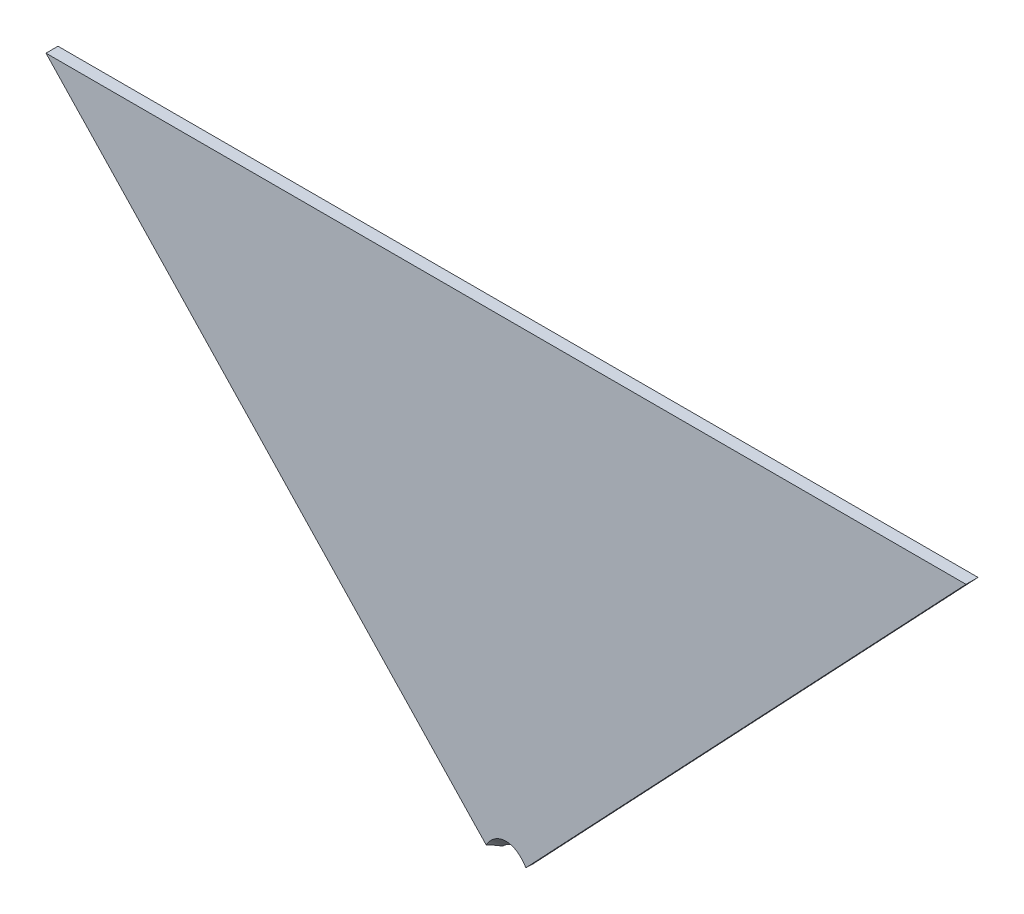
ISO-10303-21;
HEADER;
FILE_DESCRIPTION(('STEP AP214'),'2;1');
FILE_NAME('part.step','',(''),(''),'','','');
FILE_SCHEMA(('AUTOMOTIVE_DESIGN { 1 0 10303 214 1 1 1 1 }'));
ENDSEC;
DATA;
#1=APPLICATION_CONTEXT('core data for automotive mechanical design processes');
#2=APPLICATION_PROTOCOL_DEFINITION('international standard','automotive_design',2000,#1);
#3=PRODUCT_CONTEXT('',#1,'mechanical');
#4=PRODUCT('Part','Part','',(#3));
#5=PRODUCT_RELATED_PRODUCT_CATEGORY('part','',(#4));
#6=PRODUCT_DEFINITION_FORMATION('','',#4);
#7=PRODUCT_DEFINITION_CONTEXT('part definition',#1,'design');
#8=PRODUCT_DEFINITION('design','',#6,#7);
#9=PRODUCT_DEFINITION_SHAPE('','',#8);
#10=(LENGTH_UNIT() NAMED_UNIT(*) SI_UNIT(.MILLI.,.METRE.));
#11=(NAMED_UNIT(*) PLANE_ANGLE_UNIT() SI_UNIT($,.RADIAN.));
#12=(NAMED_UNIT(*) SI_UNIT($,.STERADIAN.) SOLID_ANGLE_UNIT());
#13=UNCERTAINTY_MEASURE_WITH_UNIT(LENGTH_MEASURE(1.E-05),#10,'distance_accuracy_value','');
#14=(GEOMETRIC_REPRESENTATION_CONTEXT(3) GLOBAL_UNCERTAINTY_ASSIGNED_CONTEXT((#13)) GLOBAL_UNIT_ASSIGNED_CONTEXT((#10,
#11,#12)) REPRESENTATION_CONTEXT('',''));
#15=CARTESIAN_POINT('',(0.,0.,0.));
#16=DIRECTION('',(0.,0.,1.));
#17=DIRECTION('',(1.,0.,0.));
#18=AXIS2_PLACEMENT_3D('',#15,#16,#17);
#19=CARTESIAN_POINT('',(-284.066242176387,9.70603070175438,15.));
#20=DIRECTION('',(0.,-1.,0.));
#21=DIRECTION('',(0.,0.,-1.));
#22=AXIS2_PLACEMENT_3D('',#19,#20,#21);
#23=PLANE('',#22);
#24=DIRECTION('',(-1.,0.,0.));
#25=VECTOR('',#24,1.);
#26=CARTESIAN_POINT('',(-284.066242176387,9.70603070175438,0.));
#27=LINE('',#26,#25);
#28=CARTESIAN_POINT('',(865.933757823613,9.70603070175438,0.));
#29=VERTEX_POINT('',#28);
#30=CARTESIAN_POINT('',(-284.066242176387,9.70603070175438,0.));
#31=VERTEX_POINT('',#30);
#32=EDGE_CURVE('E91',#29,#31,#27,.T.);
#33=ORIENTED_EDGE('',*,*,#32,.T.);
#34=DIRECTION('',(0.,0.,-1.));
#35=VECTOR('',#34,1.);
#36=CARTESIAN_POINT('',(-284.066242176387,9.70603070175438,15.));
#37=LINE('',#36,#35);
#38=CARTESIAN_POINT('',(-284.066242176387,9.70603070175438,15.));
#39=VERTEX_POINT('',#38);
#40=EDGE_CURVE('E46',#39,#31,#37,.T.);
#41=ORIENTED_EDGE('',*,*,#40,.F.);
#42=DIRECTION('',(-1.,0.,0.));
#43=VECTOR('',#42,1.);
#44=CARTESIAN_POINT('',(-284.066242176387,9.70603070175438,15.));
#45=LINE('',#44,#43);
#46=CARTESIAN_POINT('',(865.933757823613,9.70603070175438,15.));
#47=VERTEX_POINT('',#46);
#48=EDGE_CURVE('E85',#47,#39,#45,.T.);
#49=ORIENTED_EDGE('',*,*,#48,.F.);
#50=DIRECTION('',(0.,0.,-1.));
#51=VECTOR('',#50,1.);
#52=CARTESIAN_POINT('',(865.933757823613,9.70603070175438,15.));
#53=LINE('',#52,#51);
#54=EDGE_CURVE('E78',#47,#29,#53,.T.);
#55=ORIENTED_EDGE('',*,*,#54,.T.);
#56=EDGE_LOOP('',(#33,#41,#49,#55));
#57=FACE_BOUND('',#56,.T.);
#58=ADVANCED_FACE('F39',(#57),#23,.F.);
#59=CARTESIAN_POINT('',(-284.066242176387,9.70603070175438,15.));
#60=DIRECTION('',(0.726667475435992,0.686989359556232,0.));
#61=DIRECTION('',(-0.686989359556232,0.726667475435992,0.));
#62=AXIS2_PLACEMENT_3D('',#59,#60,#61);
#63=PLANE('',#62);
#64=DIRECTION('',(0.686989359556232,-0.726667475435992,0.));
#65=VECTOR('',#64,1.);
#66=CARTESIAN_POINT('',(-284.066242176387,9.70603070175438,0.));
#67=LINE('',#66,#65);
#68=CARTESIAN_POINT('',(271.827430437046,-578.294126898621,0.));
#69=VERTEX_POINT('',#68);
#70=EDGE_CURVE('E86',#31,#69,#67,.T.);
#71=ORIENTED_EDGE('',*,*,#70,.T.);
#72=CARTESIAN_POINT('',(290.933757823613,-598.503969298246,15.0000000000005));
#73=DIRECTION('',(0.726667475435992,0.686989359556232,0.));
#74=DIRECTION('',(-0.378715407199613,0.400588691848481,0.834328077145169));
#75=AXIS2_PLACEMENT_3D('',#72,#73,#74);
#76=ELLIPSE('',#75,68.1571157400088,31.5000000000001);
#77=CARTESIAN_POINT('',(266.127350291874,-572.26482995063,15.));
#78=VERTEX_POINT('',#77);
#79=EDGE_CURVE('E53',#69,#78,#76,.T.);
#80=ORIENTED_EDGE('',*,*,#79,.T.);
#81=DIRECTION('',(0.686989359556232,-0.726667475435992,0.));
#82=VECTOR('',#81,1.);
#83=CARTESIAN_POINT('',(-284.066242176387,9.70603070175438,15.));
#84=LINE('',#83,#82);
#85=EDGE_CURVE('E106',#39,#78,#84,.T.);
#86=ORIENTED_EDGE('',*,*,#85,.F.);
#87=ORIENTED_EDGE('',*,*,#40,.T.);
#88=EDGE_LOOP('',(#71,#80,#86,#87));
#89=FACE_BOUND('',#88,.T.);
#90=ADVANCED_FACE('F104',(#89),#63,.F.);
#91=CARTESIAN_POINT('',(290.933757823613,-598.503969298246,15.));
#92=DIRECTION('',(-0.726667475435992,0.686989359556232,0.));
#93=DIRECTION('',(-0.686989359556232,-0.726667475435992,0.));
#94=AXIS2_PLACEMENT_3D('',#91,#92,#93);
#95=PLANE('',#94);
#96=DIRECTION('',(0.686989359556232,0.726667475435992,0.));
#97=VECTOR('',#96,1.);
#98=CARTESIAN_POINT('',(290.933757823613,-598.503969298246,15.));
#99=LINE('',#98,#97);
#100=CARTESIAN_POINT('',(315.740165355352,-572.26482995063,15.));
#101=VERTEX_POINT('',#100);
#102=EDGE_CURVE('E61',#101,#47,#99,.T.);
#103=ORIENTED_EDGE('',*,*,#102,.F.);
#104=CARTESIAN_POINT('',(290.933757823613,-598.503969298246,15.0000000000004));
#105=DIRECTION('',(-0.726667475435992,0.686989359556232,0.));
#106=DIRECTION('',(0.378715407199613,0.400588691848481,0.834328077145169));
#107=AXIS2_PLACEMENT_3D('',#104,#105,#106);
#108=ELLIPSE('',#107,68.1571157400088,31.5000000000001);
#109=CARTESIAN_POINT('',(310.04008521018,-578.294126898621,0.));
#110=VERTEX_POINT('',#109);
#111=EDGE_CURVE('E82',#101,#110,#108,.T.);
#112=ORIENTED_EDGE('',*,*,#111,.T.);
#113=DIRECTION('',(0.686989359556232,0.726667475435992,0.));
#114=VECTOR('',#113,1.);
#115=CARTESIAN_POINT('',(290.933757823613,-598.503969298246,0.));
#116=LINE('',#115,#114);
#117=EDGE_CURVE('E75',#110,#29,#116,.T.);
#118=ORIENTED_EDGE('',*,*,#117,.T.);
#119=ORIENTED_EDGE('',*,*,#54,.F.);
#120=EDGE_LOOP('',(#103,#112,#118,#119));
#121=FACE_BOUND('',#120,.T.);
#122=ADVANCED_FACE('F77',(#121),#95,.F.);
#123=CARTESIAN_POINT('',(0.,0.,15.));
#124=DIRECTION('',(0.,0.,1.));
#125=DIRECTION('',(1.,0.,0.));
#126=AXIS2_PLACEMENT_3D('',#123,#124,#125);
#127=PLANE('',#126);
#128=CARTESIAN_POINT('',(290.933757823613,-598.503969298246,15.));
#129=DIRECTION('',(0.,0.,1.));
#130=DIRECTION('',(0.,1.,0.));
#131=AXIS2_PLACEMENT_3D('',#128,#129,#130);
#132=ELLIPSE('',#131,42.5747000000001,31.5000000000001);
#133=EDGE_CURVE('E96',#101,#78,#132,.T.);
#134=ORIENTED_EDGE('',*,*,#133,.F.);
#135=ORIENTED_EDGE('',*,*,#102,.T.);
#136=ORIENTED_EDGE('',*,*,#48,.T.);
#137=ORIENTED_EDGE('',*,*,#85,.T.);
#138=EDGE_LOOP('',(#134,#135,#136,#137));
#139=FACE_BOUND('',#138,.T.);
#140=ADVANCED_FACE('F108',(#139),#127,.T.);
#141=CARTESIAN_POINT('',(0.,0.,0.));
#142=DIRECTION('',(0.,0.,1.));
#143=DIRECTION('',(1.,0.,0.));
#144=AXIS2_PLACEMENT_3D('',#141,#142,#143);
#145=PLANE('',#144);
#146=ORIENTED_EDGE('',*,*,#117,.F.);
#147=CARTESIAN_POINT('',(290.933757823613,-612.142941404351,0.));
#148=DIRECTION('',(0.,0.,1.));
#149=DIRECTION('',(0.,1.,0.));
#150=AXIS2_PLACEMENT_3D('',#147,#148,#149);
#151=ELLIPSE('',#150,42.5747000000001,31.5000000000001);
#152=EDGE_CURVE('E11',#110,#69,#151,.T.);
#153=ORIENTED_EDGE('',*,*,#152,.T.);
#154=ORIENTED_EDGE('',*,*,#70,.F.);
#155=ORIENTED_EDGE('',*,*,#32,.F.);
#156=EDGE_LOOP('',(#146,#153,#154,#155));
#157=FACE_BOUND('',#156,.T.);
#158=ADVANCED_FACE('F93',(#157),#145,.F.);
#159=CARTESIAN_POINT('',(290.933757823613,-605.970168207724,6.78875191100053));
#160=DIRECTION('',(0.,0.672743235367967,0.739876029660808));
#161=DIRECTION('',(0.,-0.739876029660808,0.672743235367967));
#162=AXIS2_PLACEMENT_3D('',#159,#160,#161);
#163=CYLINDRICAL_SURFACE('',#162,31.5000000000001);
#164=ORIENTED_EDGE('',*,*,#133,.T.);
#165=ORIENTED_EDGE('',*,*,#79,.F.);
#166=ORIENTED_EDGE('',*,*,#152,.F.);
#167=ORIENTED_EDGE('',*,*,#111,.F.);
#168=EDGE_LOOP('',(#164,#165,#166,#167));
#169=FACE_BOUND('',#168,.T.);
#170=ADVANCED_FACE('F118',(#169),#163,.F.);
#171=CLOSED_SHELL('',(#58,#90,#122,#140,#158,#170));
#172=MANIFOLD_SOLID_BREP('B2',#171);
#173=ADVANCED_BREP_SHAPE_REPRESENTATION('',(#18,#172),#14);
#174=SHAPE_DEFINITION_REPRESENTATION(#9,#173);
ENDSEC;
END-ISO-10303-21;
